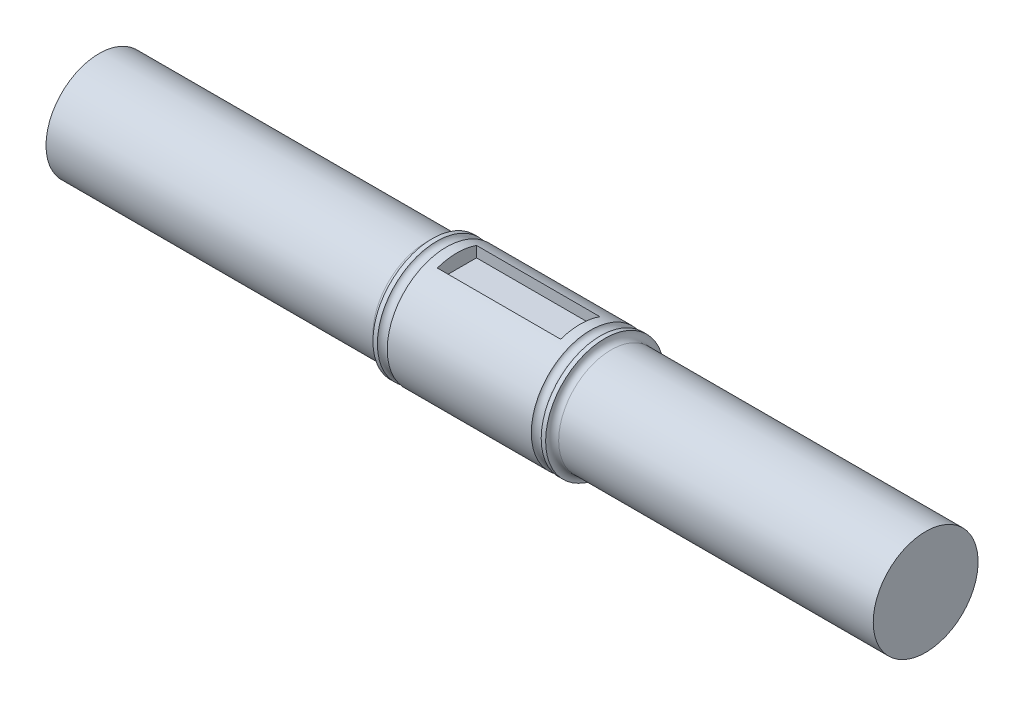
ISO-10303-21;
HEADER;
FILE_DESCRIPTION(('STEP AP214'),'2;1');
FILE_NAME('part.step','',(''),(''),'','','');
FILE_SCHEMA(('AUTOMOTIVE_DESIGN { 1 0 10303 214 1 1 1 1 }'));
ENDSEC;
DATA;
#1=APPLICATION_CONTEXT('core data for automotive mechanical design processes');
#2=APPLICATION_PROTOCOL_DEFINITION('international standard','automotive_design',2000,#1);
#3=PRODUCT_CONTEXT('',#1,'mechanical');
#4=PRODUCT('Part','Part','',(#3));
#5=PRODUCT_RELATED_PRODUCT_CATEGORY('part','',(#4));
#6=PRODUCT_DEFINITION_FORMATION('','',#4);
#7=PRODUCT_DEFINITION_CONTEXT('part definition',#1,'design');
#8=PRODUCT_DEFINITION('design','',#6,#7);
#9=PRODUCT_DEFINITION_SHAPE('','',#8);
#10=(LENGTH_UNIT() NAMED_UNIT(*) SI_UNIT(.MILLI.,.METRE.));
#11=(NAMED_UNIT(*) PLANE_ANGLE_UNIT() SI_UNIT($,.RADIAN.));
#12=(NAMED_UNIT(*) SI_UNIT($,.STERADIAN.) SOLID_ANGLE_UNIT());
#13=UNCERTAINTY_MEASURE_WITH_UNIT(LENGTH_MEASURE(1.E-05),#10,'distance_accuracy_value','');
#14=(GEOMETRIC_REPRESENTATION_CONTEXT(3) GLOBAL_UNCERTAINTY_ASSIGNED_CONTEXT((#13)) GLOBAL_UNIT_ASSIGNED_CONTEXT((#10,
#11,#12)) REPRESENTATION_CONTEXT('',''));
#15=CARTESIAN_POINT('',(0.,0.,0.));
#16=DIRECTION('',(0.,0.,1.));
#17=DIRECTION('',(1.,0.,0.));
#18=AXIS2_PLACEMENT_3D('',#15,#16,#17);
#19=CARTESIAN_POINT('',(6.65323616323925,9.52418566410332,0.));
#20=DIRECTION('',(-1.,0.,0.));
#21=DIRECTION('',(0.,0.,1.));
#22=AXIS2_PLACEMENT_3D('',#19,#20,#21);
#23=CYLINDRICAL_SURFACE('',#22,9.61317796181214);
#24=CARTESIAN_POINT('',(86.3332361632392,9.52418566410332,0.));
#25=DIRECTION('',(-1.,0.,0.));
#26=DIRECTION('',(0.,0.,1.));
#27=AXIS2_PLACEMENT_3D('',#24,#25,#26);
#28=CIRCLE('',#27,9.61317796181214);
#29=CARTESIAN_POINT('',(86.3332361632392,9.52418566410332,9.61317796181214));
#30=VERTEX_POINT('',#29);
#31=EDGE_CURVE('E141',#30,#30,#28,.T.);
#32=ORIENTED_EDGE('',*,*,#31,.T.);
#33=EDGE_LOOP('',(#32));
#34=FACE_BOUND('',#33,.T.);
#35=CARTESIAN_POINT('',(62.9767361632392,9.52418566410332,0.));
#36=DIRECTION('',(-1.,0.,0.));
#37=DIRECTION('',(0.,0.,1.));
#38=AXIS2_PLACEMENT_3D('',#35,#36,#37);
#39=CIRCLE('',#38,9.61317796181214);
#40=CARTESIAN_POINT('',(62.9767361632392,9.52418566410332,9.61317796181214));
#41=VERTEX_POINT('',#40);
#42=EDGE_CURVE('E145',#41,#41,#39,.T.);
#43=ORIENTED_EDGE('',*,*,#42,.F.);
#44=EDGE_LOOP('',(#43));
#45=FACE_BOUND('',#44,.T.);
#46=DIRECTION('',(-1.,0.,0.));
#47=VECTOR('',#46,1.);
#48=CARTESIAN_POINT('',(6.65323616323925,18.5979150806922,3.175));
#49=LINE('',#48,#47);
#50=CARTESIAN_POINT('',(84.6532361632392,18.5979150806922,3.175));
#51=VERTEX_POINT('',#50);
#52=CARTESIAN_POINT('',(64.6532361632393,18.5979150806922,3.175));
#53=VERTEX_POINT('',#52);
#54=EDGE_CURVE('E167',#51,#53,#49,.T.);
#55=ORIENTED_EDGE('',*,*,#54,.T.);
#56=CARTESIAN_POINT('',(64.6532361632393,9.52418566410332,0.));
#57=DIRECTION('',(1.,0.,0.));
#58=DIRECTION('',(0.,0.,-1.));
#59=AXIS2_PLACEMENT_3D('',#56,#57,#58);
#60=CIRCLE('',#59,9.61317796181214);
#61=CARTESIAN_POINT('',(64.6532361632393,18.5979150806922,-3.175));
#62=VERTEX_POINT('',#61);
#63=EDGE_CURVE('E11',#53,#62,#60,.F.);
#64=ORIENTED_EDGE('',*,*,#63,.T.);
#65=DIRECTION('',(-1.,0.,0.));
#66=VECTOR('',#65,1.);
#67=CARTESIAN_POINT('',(6.65323616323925,18.5979150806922,-3.175));
#68=LINE('',#67,#66);
#69=CARTESIAN_POINT('',(84.6532361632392,18.5979150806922,-3.175));
#70=VERTEX_POINT('',#69);
#71=EDGE_CURVE('E56',#62,#70,#68,.F.);
#72=ORIENTED_EDGE('',*,*,#71,.T.);
#73=CARTESIAN_POINT('',(84.6532361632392,9.52418566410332,0.));
#74=DIRECTION('',(1.,0.,0.));
#75=DIRECTION('',(0.,0.,-1.));
#76=AXIS2_PLACEMENT_3D('',#73,#74,#75);
#77=CIRCLE('',#76,9.61317796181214);
#78=EDGE_CURVE('E94',#51,#70,#77,.F.);
#79=ORIENTED_EDGE('',*,*,#78,.F.);
#80=EDGE_LOOP('',(#55,#64,#72,#79));
#81=FACE_BOUND('',#80,.T.);
#82=ADVANCED_FACE('F47',(#34,#45,#81),#23,.T.);
#83=CARTESIAN_POINT('',(6.65323616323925,0.,0.));
#84=DIRECTION('',(1.,0.,0.));
#85=DIRECTION('',(0.,0.,-1.));
#86=AXIS2_PLACEMENT_3D('',#83,#84,#85);
#87=PLANE('',#86);
#88=CARTESIAN_POINT('',(6.65323616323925,9.52418566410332,0.));
#89=DIRECTION('',(-1.,0.,0.));
#90=DIRECTION('',(0.,0.,1.));
#91=AXIS2_PLACEMENT_3D('',#88,#89,#90);
#92=CIRCLE('',#91,8.61317796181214);
#93=CARTESIAN_POINT('',(6.65323616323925,9.52418566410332,8.61317796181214));
#94=VERTEX_POINT('',#93);
#95=EDGE_CURVE('E161',#94,#94,#92,.T.);
#96=ORIENTED_EDGE('',*,*,#95,.T.);
#97=EDGE_LOOP('',(#96));
#98=FACE_BOUND('',#97,.T.);
#99=ADVANCED_FACE('F49',(#98),#87,.F.);
#100=CARTESIAN_POINT('',(6.65323616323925,9.52418566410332,0.));
#101=DIRECTION('',(-1.,0.,0.));
#102=DIRECTION('',(0.,0.,1.));
#103=AXIS2_PLACEMENT_3D('',#100,#101,#102);
#104=CYLINDRICAL_SURFACE('',#103,8.61317796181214);
#105=CARTESIAN_POINT('',(59.6532361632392,9.52418566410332,0.));
#106=DIRECTION('',(-1.,0.,0.));
#107=DIRECTION('',(0.,0.,1.));
#108=AXIS2_PLACEMENT_3D('',#105,#106,#107);
#109=CIRCLE('',#108,8.61317796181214);
#110=CARTESIAN_POINT('',(59.6532361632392,9.52418566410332,8.61317796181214));
#111=VERTEX_POINT('',#110);
#112=EDGE_CURVE('E157',#111,#111,#109,.T.);
#113=ORIENTED_EDGE('',*,*,#112,.T.);
#114=EDGE_LOOP('',(#113));
#115=FACE_BOUND('',#114,.T.);
#116=ORIENTED_EDGE('',*,*,#95,.F.);
#117=EDGE_LOOP('',(#116));
#118=FACE_BOUND('',#117,.T.);
#119=ADVANCED_FACE('F191',(#115,#118),#104,.T.);
#120=CARTESIAN_POINT('',(59.6532361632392,9.52418566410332,0.));
#121=DIRECTION('',(-1.,0.,0.));
#122=DIRECTION('',(0.,0.,1.));
#123=AXIS2_PLACEMENT_3D('',#120,#121,#122);
#124=TOROIDAL_SURFACE('',#123,9.61317796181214,0.999999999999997);
#125=ORIENTED_EDGE('',*,*,#112,.F.);
#126=EDGE_LOOP('',(#125));
#127=FACE_BOUND('',#126,.T.);
#128=CARTESIAN_POINT('',(60.6532361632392,9.52418566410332,0.));
#129=DIRECTION('',(-1.,0.,0.));
#130=DIRECTION('',(0.,0.,1.));
#131=AXIS2_PLACEMENT_3D('',#128,#129,#130);
#132=CIRCLE('',#131,9.61317796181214);
#133=CARTESIAN_POINT('',(60.6532361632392,9.52418566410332,9.61317796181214));
#134=VERTEX_POINT('',#133);
#135=EDGE_CURVE('E153',#134,#134,#132,.T.);
#136=ORIENTED_EDGE('',*,*,#135,.T.);
#137=EDGE_LOOP('',(#136));
#138=FACE_BOUND('',#137,.T.);
#139=ADVANCED_FACE('F205',(#127,#138),#124,.F.);
#140=CARTESIAN_POINT('',(6.65323616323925,9.52418566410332,0.));
#141=DIRECTION('',(-1.,0.,0.));
#142=DIRECTION('',(0.,0.,1.));
#143=AXIS2_PLACEMENT_3D('',#140,#141,#142);
#144=CYLINDRICAL_SURFACE('',#143,9.61317796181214);
#145=CARTESIAN_POINT('',(61.3767361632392,9.52418566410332,0.));
#146=DIRECTION('',(-1.,0.,0.));
#147=DIRECTION('',(0.,0.,1.));
#148=AXIS2_PLACEMENT_3D('',#145,#146,#147);
#149=CIRCLE('',#148,9.61317796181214);
#150=CARTESIAN_POINT('',(61.3767361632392,9.52418566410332,9.61317796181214));
#151=VERTEX_POINT('',#150);
#152=EDGE_CURVE('E149',#151,#151,#149,.T.);
#153=ORIENTED_EDGE('',*,*,#152,.T.);
#154=EDGE_LOOP('',(#153));
#155=FACE_BOUND('',#154,.T.);
#156=ORIENTED_EDGE('',*,*,#135,.F.);
#157=EDGE_LOOP('',(#156));
#158=FACE_BOUND('',#157,.T.);
#159=ADVANCED_FACE('F201',(#155,#158),#144,.T.);
#160=CARTESIAN_POINT('',(62.1767361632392,9.52418566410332,0.));
#161=DIRECTION('',(-1.,0.,0.));
#162=DIRECTION('',(0.,0.,1.));
#163=AXIS2_PLACEMENT_3D('',#160,#161,#162);
#164=TOROIDAL_SURFACE('',#163,10.0031649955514,0.889994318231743);
#165=ORIENTED_EDGE('',*,*,#42,.T.);
#166=EDGE_LOOP('',(#165));
#167=FACE_BOUND('',#166,.T.);
#168=ORIENTED_EDGE('',*,*,#152,.F.);
#169=EDGE_LOOP('',(#168));
#170=FACE_BOUND('',#169,.T.);
#171=ADVANCED_FACE('F198',(#167,#170),#164,.F.);
#172=CARTESIAN_POINT('',(87.1332361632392,9.52418566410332,0.));
#173=DIRECTION('',(-1.,0.,0.));
#174=DIRECTION('',(0.,0.,1.));
#175=AXIS2_PLACEMENT_3D('',#172,#173,#174);
#176=TOROIDAL_SURFACE('',#175,10.0050162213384,0.890807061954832);
#177=CARTESIAN_POINT('',(87.9332361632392,9.52418566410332,0.));
#178=DIRECTION('',(-1.,0.,0.));
#179=DIRECTION('',(0.,0.,1.));
#180=AXIS2_PLACEMENT_3D('',#177,#178,#179);
#181=CIRCLE('',#180,9.61317796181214);
#182=CARTESIAN_POINT('',(87.9332361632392,9.52418566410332,9.61317796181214));
#183=VERTEX_POINT('',#182);
#184=EDGE_CURVE('E137',#183,#183,#181,.T.);
#185=ORIENTED_EDGE('',*,*,#184,.T.);
#186=EDGE_LOOP('',(#185));
#187=FACE_BOUND('',#186,.T.);
#188=ORIENTED_EDGE('',*,*,#31,.F.);
#189=EDGE_LOOP('',(#188));
#190=FACE_BOUND('',#189,.T.);
#191=ADVANCED_FACE('F196',(#187,#190),#176,.F.);
#192=CARTESIAN_POINT('',(6.65323616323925,9.52418566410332,0.));
#193=DIRECTION('',(-1.,0.,0.));
#194=DIRECTION('',(0.,0.,1.));
#195=AXIS2_PLACEMENT_3D('',#192,#193,#194);
#196=CYLINDRICAL_SURFACE('',#195,9.61317796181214);
#197=CARTESIAN_POINT('',(88.6532361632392,9.52418566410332,0.));
#198=DIRECTION('',(-1.,0.,0.));
#199=DIRECTION('',(0.,0.,1.));
#200=AXIS2_PLACEMENT_3D('',#197,#198,#199);
#201=CIRCLE('',#200,9.61317796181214);
#202=CARTESIAN_POINT('',(88.6532361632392,9.52418566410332,9.61317796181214));
#203=VERTEX_POINT('',#202);
#204=EDGE_CURVE('E133',#203,#203,#201,.T.);
#205=ORIENTED_EDGE('',*,*,#204,.T.);
#206=EDGE_LOOP('',(#205));
#207=FACE_BOUND('',#206,.T.);
#208=ORIENTED_EDGE('',*,*,#184,.F.);
#209=EDGE_LOOP('',(#208));
#210=FACE_BOUND('',#209,.T.);
#211=ADVANCED_FACE('F243',(#207,#210),#196,.T.);
#212=CARTESIAN_POINT('',(89.6468085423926,9.52418566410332,0.));
#213=DIRECTION('',(-1.,0.,0.));
#214=DIRECTION('',(0.,0.,1.));
#215=AXIS2_PLACEMENT_3D('',#212,#213,#214);
#216=TOROIDAL_SURFACE('',#215,9.49997934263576,0.999999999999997);
#217=CARTESIAN_POINT('',(89.6532361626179,9.52418566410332,0.));
#218=DIRECTION('',(-1.,0.,0.));
#219=DIRECTION('',(0.,0.,1.));
#220=AXIS2_PLACEMENT_3D('',#217,#218,#219);
#221=CIRCLE('',#220,8.5);
#222=CARTESIAN_POINT('',(89.6532361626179,9.52418566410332,8.5));
#223=VERTEX_POINT('',#222);
#224=EDGE_CURVE('E129',#223,#223,#221,.T.);
#225=ORIENTED_EDGE('',*,*,#224,.T.);
#226=EDGE_LOOP('',(#225));
#227=FACE_BOUND('',#226,.T.);
#228=ORIENTED_EDGE('',*,*,#204,.F.);
#229=EDGE_LOOP('',(#228));
#230=FACE_BOUND('',#229,.T.);
#231=ADVANCED_FACE('F251',(#227,#230),#216,.F.);
#232=CARTESIAN_POINT('',(6.65323616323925,9.52418566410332,0.));
#233=DIRECTION('',(-1.,0.,0.));
#234=DIRECTION('',(0.,0.,1.));
#235=AXIS2_PLACEMENT_3D('',#232,#233,#234);
#236=CYLINDRICAL_SURFACE('',#235,8.5);
#237=CARTESIAN_POINT('',(140.653236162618,9.52418566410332,0.));
#238=DIRECTION('',(-1.,0.,0.));
#239=DIRECTION('',(0.,0.,1.));
#240=AXIS2_PLACEMENT_3D('',#237,#238,#239);
#241=CIRCLE('',#240,8.5);
#242=CARTESIAN_POINT('',(140.653236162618,9.52418566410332,8.5));
#243=VERTEX_POINT('',#242);
#244=EDGE_CURVE('E106',#243,#243,#241,.T.);
#245=ORIENTED_EDGE('',*,*,#244,.T.);
#246=EDGE_LOOP('',(#245));
#247=FACE_BOUND('',#246,.T.);
#248=ORIENTED_EDGE('',*,*,#224,.F.);
#249=EDGE_LOOP('',(#248));
#250=FACE_BOUND('',#249,.T.);
#251=ADVANCED_FACE('F259',(#247,#250),#236,.T.);
#252=CARTESIAN_POINT('',(140.653236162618,0.,0.));
#253=DIRECTION('',(1.,0.,0.));
#254=DIRECTION('',(0.,0.,-1.));
#255=AXIS2_PLACEMENT_3D('',#252,#253,#254);
#256=PLANE('',#255);
#257=ORIENTED_EDGE('',*,*,#244,.F.);
#258=EDGE_LOOP('',(#257));
#259=FACE_BOUND('',#258,.T.);
#260=ADVANCED_FACE('F267',(#259),#256,.T.);
#261=CARTESIAN_POINT('',(64.6532361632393,16.8498222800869,-3.175));
#262=DIRECTION('',(0.,0.,1.));
#263=DIRECTION('',(1.,0.,0.));
#264=AXIS2_PLACEMENT_3D('',#261,#262,#263);
#265=PLANE('',#264);
#266=DIRECTION('',(0.,-1.,0.));
#267=VECTOR('',#266,1.);
#268=CARTESIAN_POINT('',(64.6532361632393,16.8498222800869,-3.175));
#269=LINE('',#268,#267);
#270=CARTESIAN_POINT('',(64.6532361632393,16.8498222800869,-3.175));
#271=VERTEX_POINT('',#270);
#272=EDGE_CURVE('E102',#62,#271,#269,.T.);
#273=ORIENTED_EDGE('',*,*,#272,.T.);
#274=DIRECTION('',(1.,0.,0.));
#275=VECTOR('',#274,1.);
#276=CARTESIAN_POINT('',(64.6532361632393,16.8498222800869,-3.175));
#277=LINE('',#276,#275);
#278=CARTESIAN_POINT('',(84.6532361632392,16.8498222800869,-3.175));
#279=VERTEX_POINT('',#278);
#280=EDGE_CURVE('E100',#271,#279,#277,.T.);
#281=ORIENTED_EDGE('',*,*,#280,.T.);
#282=DIRECTION('',(0.,-1.,0.));
#283=VECTOR('',#282,1.);
#284=CARTESIAN_POINT('',(84.6532361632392,16.8498222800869,-3.175));
#285=LINE('',#284,#283);
#286=EDGE_CURVE('E88',#70,#279,#285,.T.);
#287=ORIENTED_EDGE('',*,*,#286,.F.);
#288=ORIENTED_EDGE('',*,*,#71,.F.);
#289=EDGE_LOOP('',(#273,#281,#287,#288));
#290=FACE_BOUND('',#289,.T.);
#291=ADVANCED_FACE('F101',(#290),#265,.T.);
#292=CARTESIAN_POINT('',(64.6532361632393,16.8498222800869,-3.175));
#293=DIRECTION('',(0.,1.,0.));
#294=DIRECTION('',(0.,0.,1.));
#295=AXIS2_PLACEMENT_3D('',#292,#293,#294);
#296=PLANE('',#295);
#297=ORIENTED_EDGE('',*,*,#280,.F.);
#298=DIRECTION('',(0.,0.,1.));
#299=VECTOR('',#298,1.);
#300=CARTESIAN_POINT('',(64.6532361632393,16.8498222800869,-3.175));
#301=LINE('',#300,#299);
#302=CARTESIAN_POINT('',(64.6532361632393,16.8498222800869,3.175));
#303=VERTEX_POINT('',#302);
#304=EDGE_CURVE('E118',#271,#303,#301,.T.);
#305=ORIENTED_EDGE('',*,*,#304,.T.);
#306=DIRECTION('',(1.,0.,0.));
#307=VECTOR('',#306,1.);
#308=CARTESIAN_POINT('',(64.6532361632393,16.8498222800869,3.175));
#309=LINE('',#308,#307);
#310=CARTESIAN_POINT('',(84.6532361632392,16.8498222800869,3.175));
#311=VERTEX_POINT('',#310);
#312=EDGE_CURVE('E107',#303,#311,#309,.T.);
#313=ORIENTED_EDGE('',*,*,#312,.T.);
#314=DIRECTION('',(0.,0.,1.));
#315=VECTOR('',#314,1.);
#316=CARTESIAN_POINT('',(84.6532361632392,16.8498222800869,-3.175));
#317=LINE('',#316,#315);
#318=EDGE_CURVE('E92',#279,#311,#317,.T.);
#319=ORIENTED_EDGE('',*,*,#318,.F.);
#320=EDGE_LOOP('',(#297,#305,#313,#319));
#321=FACE_BOUND('',#320,.T.);
#322=ADVANCED_FACE('F109',(#321),#296,.T.);
#323=CARTESIAN_POINT('',(64.6532361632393,16.8498222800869,3.175));
#324=DIRECTION('',(0.,0.,-1.));
#325=DIRECTION('',(-1.,0.,0.));
#326=AXIS2_PLACEMENT_3D('',#323,#324,#325);
#327=PLANE('',#326);
#328=DIRECTION('',(0.,1.,0.));
#329=VECTOR('',#328,1.);
#330=CARTESIAN_POINT('',(84.6532361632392,16.8498222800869,3.175));
#331=LINE('',#330,#329);
#332=EDGE_CURVE('E63',#311,#51,#331,.T.);
#333=ORIENTED_EDGE('',*,*,#332,.F.);
#334=ORIENTED_EDGE('',*,*,#312,.F.);
#335=DIRECTION('',(0.,1.,0.));
#336=VECTOR('',#335,1.);
#337=CARTESIAN_POINT('',(64.6532361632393,16.8498222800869,3.175));
#338=LINE('',#337,#336);
#339=EDGE_CURVE('E121',#303,#53,#338,.T.);
#340=ORIENTED_EDGE('',*,*,#339,.T.);
#341=ORIENTED_EDGE('',*,*,#54,.F.);
#342=EDGE_LOOP('',(#333,#334,#340,#341));
#343=FACE_BOUND('',#342,.T.);
#344=ADVANCED_FACE('F174',(#343),#327,.T.);
#345=CARTESIAN_POINT('',(64.6532361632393,0.,0.));
#346=DIRECTION('',(1.,0.,0.));
#347=DIRECTION('',(0.,0.,-1.));
#348=AXIS2_PLACEMENT_3D('',#345,#346,#347);
#349=PLANE('',#348);
#350=ORIENTED_EDGE('',*,*,#339,.F.);
#351=ORIENTED_EDGE('',*,*,#304,.F.);
#352=ORIENTED_EDGE('',*,*,#272,.F.);
#353=ORIENTED_EDGE('',*,*,#63,.F.);
#354=EDGE_LOOP('',(#350,#351,#352,#353));
#355=FACE_BOUND('',#354,.T.);
#356=ADVANCED_FACE('F172',(#355),#349,.T.);
#357=CARTESIAN_POINT('',(84.6532361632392,0.,0.));
#358=DIRECTION('',(1.,0.,0.));
#359=DIRECTION('',(0.,0.,-1.));
#360=AXIS2_PLACEMENT_3D('',#357,#358,#359);
#361=PLANE('',#360);
#362=ORIENTED_EDGE('',*,*,#78,.T.);
#363=ORIENTED_EDGE('',*,*,#286,.T.);
#364=ORIENTED_EDGE('',*,*,#318,.T.);
#365=ORIENTED_EDGE('',*,*,#332,.T.);
#366=EDGE_LOOP('',(#362,#363,#364,#365));
#367=FACE_BOUND('',#366,.T.);
#368=ADVANCED_FACE('F90',(#367),#361,.F.);
#369=CLOSED_SHELL('',(#82,#99,#119,#139,#159,#171,#191,#211,#231,#251,#260,#291,#322,#344,#356,#368));
#370=MANIFOLD_SOLID_BREP('B2',#369);
#371=ADVANCED_BREP_SHAPE_REPRESENTATION('',(#18,#370),#14);
#372=SHAPE_DEFINITION_REPRESENTATION(#9,#371);
ENDSEC;
END-ISO-10303-21;
